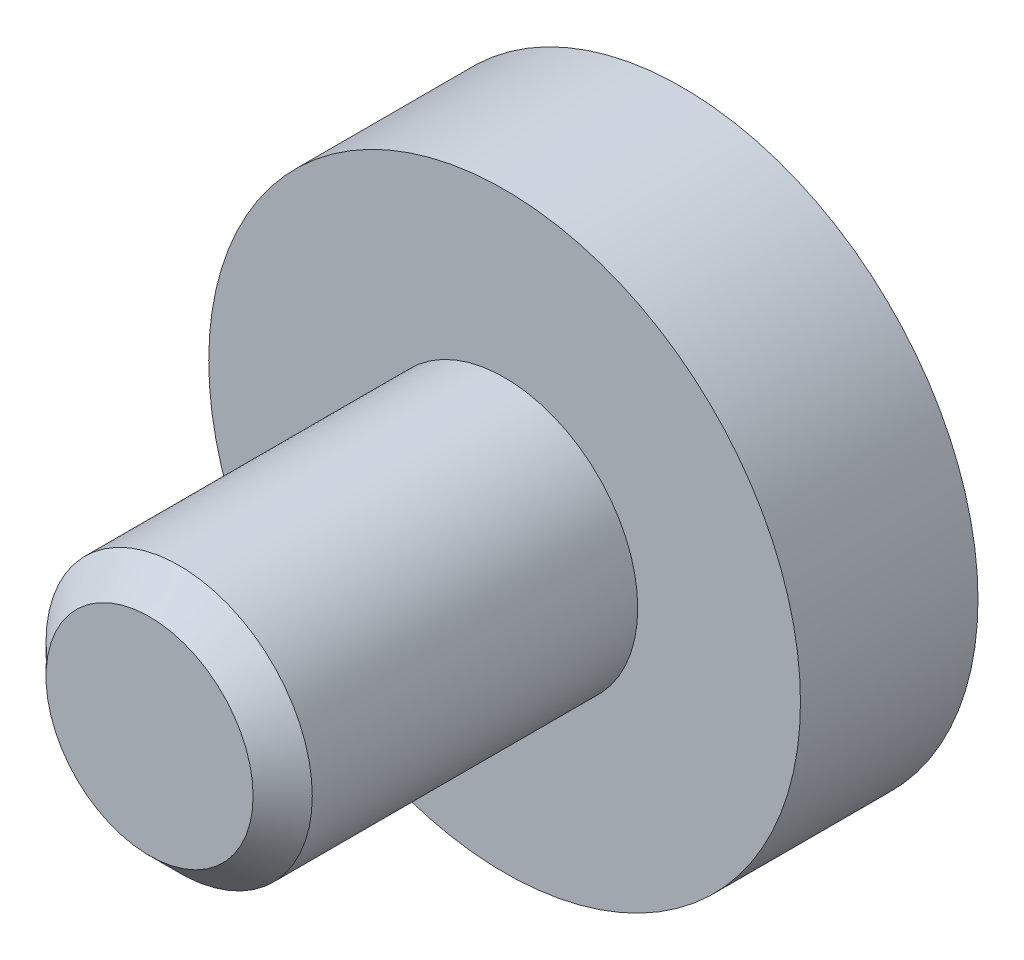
from build123d import *

# Parameters (mm, degrees)
ESQUISSE1_R        = 5
BOSS_EXTRU_1_DEPTH = 3
ESQUISSE2_R        = 2.25
BOSS_EXTRU_2_DEPTH = 6
CHANFREIN1_SIZE    = 0.5


with BuildPart() as part:
    # Esquisse1 → Boss.-Extru.1 (new body)
    with BuildSketch(Plane.XY):
        Circle(ESQUISSE1_R)
    extrude(amount=BOSS_EXTRU_1_DEPTH)

    # Esquisse2 → Boss.-Extru.2 (add)
    with BuildSketch(Plane.XY.offset(3)):
        Circle(ESQUISSE2_R)
    extrude(amount=BOSS_EXTRU_2_DEPTH)

    # Chanfrein1
    chanfrein1_edges = [part.edges().sort_by_distance(p)[0] for p in [
        (-2.25, 0, 9),
    ]]
    chamfer(chanfrein1_edges, length=CHANFREIN1_SIZE)


solid = part.part
